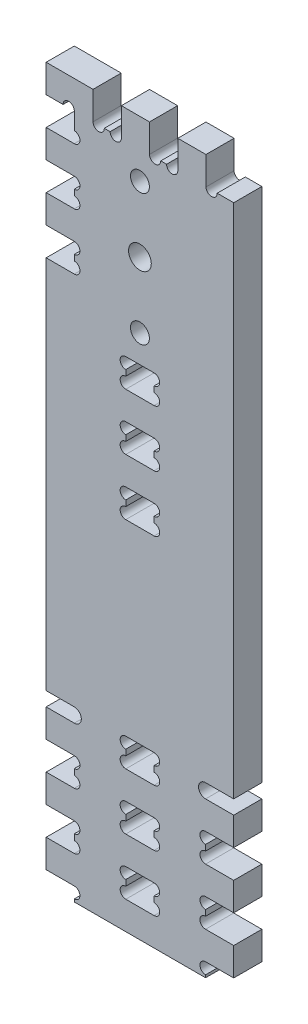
from build123d import *

# Parameters (mm, degrees)
AUFSATZ_LINEAR_AUSTRAGEN1_DEPTH = 15
SCHNITT_LINEAR_AUSTRAGEN5_DEPTH = 17.5
SKIZZE6_R                       = 5.05
SCHNITT_LINEAR_AUSTRAGEN6_DEPTH = 7.5
SKIZZE8_R                       = 6.05
SKIZZE8_R_2                     = 3
SCHNITT_LINEAR_AUSTRAGEN7_DEPTH = 17.5


with BuildPart() as part:
    # Skizze1 → Aufsatz-Linear austragen1 (new body)
    with BuildSketch(Plane.XY):
        with BuildLine():
            Line((0, 82.6), (15, 82.6))
            ThreePointArc((15, 82.6), (18.75, 86.35), (15, 90.1))
            Line((15, 90.1), (0, 90.1))
            Line((0, 90.1), (0, 289.970539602))
            Line((0, 289.970539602), (15, 289.970539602))
            ThreePointArc((15, 289.970539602), (18, 292.970539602), (15, 295.970539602))
            Line((15, 295.970539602), (15, 299.070539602))
            ThreePointArc((15, 299.070539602), (18, 302.070539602), (15, 305.070539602))
            Line((15, 305.070539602), (0, 305.070539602))
            Line((0, 305.070539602), (0, 320.070539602))
            Line((0, 320.070539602), (15, 320.070539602))
            ThreePointArc((15, 320.070539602), (18, 323.070539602), (15, 326.070539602))
            Line((15, 326.070539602), (15, 329.170539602))
            ThreePointArc((15, 329.170539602), (18, 332.170539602), (15, 335.170539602))
            Line((15, 335.170539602), (0, 335.170539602))
            Line((0, 335.170539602), (0, 350.170539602))
            Line((0, 350.170539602), (15, 350.170539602))
            ThreePointArc((15, 350.170539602), (18, 353.170539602), (15, 356.170539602))
            Line((15, 356.170539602), (15, 365.270539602))
            ThreePointArc((15, 365.270539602), (12, 368.270539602), (9, 365.270539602))
            Line((9, 365.270539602), (0, 365.270539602))
            Line((0, 365.270539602), (0, 380.270539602))
            Line((0, 380.270539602), (25, 380.270539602))
            Line((25, 380.270539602), (25, 365.270539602))
            ThreePointArc((25, 365.270539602), (27.999984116, 362.270539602), (31, 365.270507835))
            Line((31, 365.270507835), (34.1, 365.270507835))
            ThreePointArc((34.1, 365.270507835), (37.100015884, 362.270539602), (40.1, 365.270539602))
            Line((40.1, 365.270539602), (40.1, 380.270539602))
            Line((40.1, 380.270539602), (55.1, 380.270539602))
            Line((55.1, 380.270539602), (55.1, 365.270539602))
            ThreePointArc((55.1, 365.270539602), (58.099988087, 362.270539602), (61.1, 365.270515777))
            Line((61.1, 365.270515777), (64.2, 365.270515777))
            ThreePointArc((64.2, 365.270515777), (67.200009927, 362.270535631), (70.2, 365.270535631))
            Line((70.2, 365.270535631), (70.2, 380.270535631))
            Line((70.2, 380.270535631), (85.2, 380.270535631))
            Line((85.2, 380.270535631), (85.2, 365.270535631))
            ThreePointArc((85.2, 365.270535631), (88.264732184, 362.335267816), (91.2, 365.4))
            Line((91.2, 365.4), (100, 365.4))
            Line((100, 365.4), (100, 90.1))
            Line((100, 90.1), (85, 90.1))
            ThreePointArc((85, 90.1), (81.25, 86.35), (85, 82.6))
            Line((85, 82.6), (100, 82.6))
            Line((100, 82.6), (100, 67.6))
            Line((100, 67.6), (85, 67.6))
            ThreePointArc((85, 67.6), (82, 64.6), (85, 61.6))
            Line((85, 61.6), (85, 58.5))
            ThreePointArc((85, 58.5), (82, 55.5), (85, 52.5))
            Line((85, 52.5), (100, 52.5))
            Line((100, 52.5), (100, 37.5))
            Line((100, 37.5), (85, 37.5))
            ThreePointArc((85, 37.5), (82, 34.5), (85, 31.5))
            Line((85, 31.5), (85, 28.4))
            ThreePointArc((85, 28.4), (82, 25.4), (85, 22.4))
            Line((85, 22.4), (100, 22.4))
            Line((100, 22.4), (100, 7.4))
            Line((100, 7.4), (85, 7.4))
            ThreePointArc((85, 7.4), (82, 4.4), (85, 1.4))
            Line((85, 1.4), (85, 0))
            Line((85, 0), (15, 0))
            Line((15, 0), (15, 1.4))
            ThreePointArc((15, 1.4), (18, 4.4), (15, 7.4))
            Line((15, 7.4), (0, 7.4))
            Line((0, 7.4), (0, 22.4))
            Line((0, 22.4), (15, 22.4))
            ThreePointArc((15, 22.4), (18, 25.4), (15, 28.4))
            Line((15, 28.4), (15, 31.5))
            ThreePointArc((15, 31.5), (18, 34.5), (15, 37.5))
            Line((15, 37.5), (0, 37.5))
            Line((0, 37.5), (0, 52.5))
            Line((0, 52.5), (15, 52.5))
            ThreePointArc((15, 52.5), (18, 55.5), (15, 58.5))
            Line((15, 58.5), (15, 61.6))
            ThreePointArc((15, 61.6), (18, 64.6), (15, 67.6))
            Line((15, 67.6), (0, 67.6))
            Line((0, 67.6), (0, 82.6))
        make_face()
    extrude(amount=AUFSATZ_LINEAR_AUSTRAGEN1_DEPTH)

    # Skizze5 → Schnitt-Linear austragen5 (cut)
    with BuildSketch(Plane.XY.offset(15)):
        with BuildLine():
            ThreePointArc((42.45, 51.1), (39.45, 48.1), (42.45, 45.1))
            Line((42.45, 45.1), (57.55, 45.1))
            ThreePointArc((57.55, 45.1), (60.55, 48.1), (57.55, 51.1))
            Line((57.55, 51.1), (57.55, 54.2))
            ThreePointArc((57.55, 54.2), (60.55, 57.2), (57.55, 60.2))
            Line((57.55, 60.2), (42.45, 60.2))
            ThreePointArc((42.45, 60.2), (39.45, 57.2), (42.45, 54.2))
            Line((42.45, 54.2), (42.45, 51.1))
        make_face()
        with BuildLine():
            ThreePointArc((42.45, 21), (39.45, 18), (42.45, 15))
            Line((42.45, 15), (57.55, 15))
            ThreePointArc((57.55, 15), (60.55, 18), (57.55, 21))
            Line((57.55, 21), (57.55, 24.1))
            ThreePointArc((57.55, 24.1), (60.55, 27.1), (57.55, 30.1))
            Line((57.55, 30.1), (42.45, 30.1))
            ThreePointArc((42.45, 30.1), (39.45, 27.1), (42.45, 24.1))
            Line((42.45, 24.1), (42.45, 21))
        make_face()
        with BuildLine():
            ThreePointArc((42.45, 81.2), (39.45, 78.2), (42.45, 75.2))
            Line((42.45, 75.2), (57.55, 75.2))
            ThreePointArc((57.55, 75.2), (60.55, 78.2), (57.55, 81.2))
            Line((57.55, 81.2), (57.55, 84.3))
            ThreePointArc((57.55, 84.3), (60.55, 87.3), (57.55, 90.3))
            Line((57.55, 90.3), (42.45, 90.3))
            ThreePointArc((42.45, 90.3), (39.45, 87.3), (42.45, 84.3))
            Line((42.45, 84.3), (42.45, 81.2))
        make_face()
        with BuildLine():
            ThreePointArc((42.45, 226.4), (39.45, 223.4), (42.45, 220.4))
            Line((42.45, 220.4), (57.55, 220.4))
            ThreePointArc((57.55, 220.4), (60.55, 223.4), (57.55, 226.4))
            Line((57.55, 226.4), (57.55, 229.5))
            ThreePointArc((57.55, 229.5), (60.55, 232.5), (57.55, 235.5))
            Line((57.55, 235.5), (42.45, 235.5))
            ThreePointArc((42.45, 235.5), (39.45, 232.5), (42.45, 229.5))
            Line((42.45, 229.5), (42.45, 226.4))
        make_face()
        with BuildLine():
            ThreePointArc((42.45, 196.3), (39.45, 193.3), (42.45, 190.3))
            Line((42.45, 190.3), (57.55, 190.3))
            ThreePointArc((57.55, 190.3), (60.55, 193.3), (57.55, 196.3))
            Line((57.55, 196.3), (57.55, 199.4))
            ThreePointArc((57.55, 199.4), (60.55, 202.4), (57.55, 205.4))
            Line((57.55, 205.4), (42.45, 205.4))
            ThreePointArc((42.45, 205.4), (39.45, 202.4), (42.45, 199.4))
            Line((42.45, 199.4), (42.45, 196.3))
        make_face()
        with BuildLine():
            ThreePointArc((42.45, 256.5), (39.45, 253.5), (42.45, 250.5))
            Line((42.45, 250.5), (57.55, 250.5))
            ThreePointArc((57.55, 250.5), (60.55, 253.5), (57.55, 256.5))
            Line((57.55, 256.5), (57.55, 259.6))
            ThreePointArc((57.55, 259.6), (60.55, 262.6), (57.55, 265.6))
            Line((57.55, 265.6), (42.45, 265.6))
            ThreePointArc((42.45, 265.6), (39.45, 262.6), (42.45, 259.6))
            Line((42.45, 259.6), (42.45, 256.5))
        make_face()
    extrude(amount=-SCHNITT_LINEAR_AUSTRAGEN5_DEPTH, mode=Mode.SUBTRACT)

    # Skizze6 → Schnitt-Linear austragen6 (cut)
    with BuildSketch(Plane.XY.offset(15)):
        with Locations((50, 280.270515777)):
            Circle(SKIZZE6_R)
        with Locations((50, 350.270515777)):
            Circle(SKIZZE6_R)
    extrude(amount=-SCHNITT_LINEAR_AUSTRAGEN6_DEPTH, mode=Mode.SUBTRACT)

    # Skizze8 → Schnitt-Linear austragen7 (cut)
    with BuildSketch(Plane.XY.offset(15)):
        with Locations((50, 315.270539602)):
            Circle(SKIZZE8_R)
        with Locations((50, 350.270515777)):
            Circle(SKIZZE8_R_2)
        with Locations((50, 280.270515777)):
            Circle(SKIZZE8_R_2)
    extrude(amount=-SCHNITT_LINEAR_AUSTRAGEN7_DEPTH, mode=Mode.SUBTRACT)


solid = part.part
